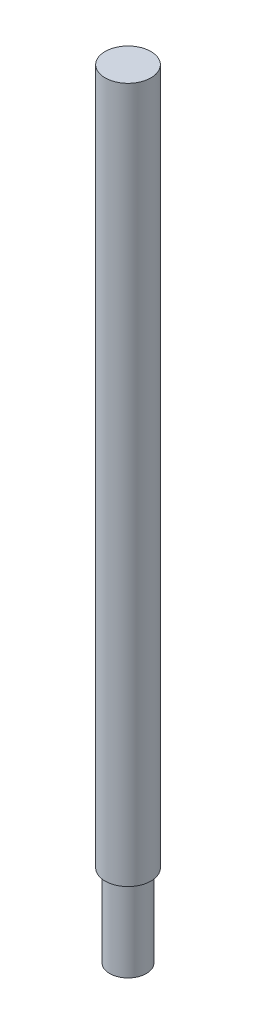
ISO-10303-21;
HEADER;
FILE_DESCRIPTION(('STEP AP214'),'2;1');
FILE_NAME('part.step','',(''),(''),'','','');
FILE_SCHEMA(('AUTOMOTIVE_DESIGN { 1 0 10303 214 1 1 1 1 }'));
ENDSEC;
DATA;
#1=APPLICATION_CONTEXT('core data for automotive mechanical design processes');
#2=APPLICATION_PROTOCOL_DEFINITION('international standard','automotive_design',2000,#1);
#3=PRODUCT_CONTEXT('',#1,'mechanical');
#4=PRODUCT('Part','Part','',(#3));
#5=PRODUCT_RELATED_PRODUCT_CATEGORY('part','',(#4));
#6=PRODUCT_DEFINITION_FORMATION('','',#4);
#7=PRODUCT_DEFINITION_CONTEXT('part definition',#1,'design');
#8=PRODUCT_DEFINITION('design','',#6,#7);
#9=PRODUCT_DEFINITION_SHAPE('','',#8);
#10=(LENGTH_UNIT() NAMED_UNIT(*) SI_UNIT(.MILLI.,.METRE.));
#11=(NAMED_UNIT(*) PLANE_ANGLE_UNIT() SI_UNIT($,.RADIAN.));
#12=(NAMED_UNIT(*) SI_UNIT($,.STERADIAN.) SOLID_ANGLE_UNIT());
#13=UNCERTAINTY_MEASURE_WITH_UNIT(LENGTH_MEASURE(1.E-05),#10,'distance_accuracy_value','');
#14=(GEOMETRIC_REPRESENTATION_CONTEXT(3) GLOBAL_UNCERTAINTY_ASSIGNED_CONTEXT((#13)) GLOBAL_UNIT_ASSIGNED_CONTEXT((#10,
#11,#12)) REPRESENTATION_CONTEXT('',''));
#15=CARTESIAN_POINT('',(0.,0.,0.));
#16=DIRECTION('',(0.,0.,1.));
#17=DIRECTION('',(1.,0.,0.));
#18=AXIS2_PLACEMENT_3D('',#15,#16,#17);
#19=CARTESIAN_POINT('',(0.,170.,0.));
#20=DIRECTION('',(0.,-1.,0.));
#21=DIRECTION('',(0.,0.,-1.));
#22=AXIS2_PLACEMENT_3D('',#19,#20,#21);
#23=CYLINDRICAL_SURFACE('',#22,5.);
#24=CARTESIAN_POINT('',(0.,170.,0.));
#25=DIRECTION('',(0.,1.,0.));
#26=DIRECTION('',(0.,0.,1.));
#27=AXIS2_PLACEMENT_3D('',#24,#25,#26);
#28=CIRCLE('',#27,5.);
#29=CARTESIAN_POINT('',(0.,170.,5.));
#30=VERTEX_POINT('',#29);
#31=EDGE_CURVE('E10',#30,#30,#28,.T.);
#32=ORIENTED_EDGE('',*,*,#31,.F.);
#33=EDGE_LOOP('',(#32));
#34=FACE_BOUND('',#33,.T.);
#35=CARTESIAN_POINT('',(0.,18.,0.));
#36=DIRECTION('',(0.,-1.,0.));
#37=DIRECTION('',(0.,0.,-1.));
#38=AXIS2_PLACEMENT_3D('',#35,#36,#37);
#39=CIRCLE('',#38,5.);
#40=CARTESIAN_POINT('',(0.,18.,-5.));
#41=VERTEX_POINT('',#40);
#42=EDGE_CURVE('E39',#41,#41,#39,.T.);
#43=ORIENTED_EDGE('',*,*,#42,.F.);
#44=EDGE_LOOP('',(#43));
#45=FACE_BOUND('',#44,.T.);
#46=ADVANCED_FACE('F33',(#34,#45),#23,.T.);
#47=CARTESIAN_POINT('',(0.,170.,0.));
#48=DIRECTION('',(0.,1.,0.));
#49=DIRECTION('',(0.,0.,1.));
#50=AXIS2_PLACEMENT_3D('',#47,#48,#49);
#51=PLANE('',#50);
#52=ORIENTED_EDGE('',*,*,#31,.T.);
#53=EDGE_LOOP('',(#52));
#54=FACE_BOUND('',#53,.T.);
#55=ADVANCED_FACE('F64',(#54),#51,.T.);
#56=CARTESIAN_POINT('',(0.,18.,0.));
#57=DIRECTION('',(0.,-1.,0.));
#58=DIRECTION('',(0.,0.,-1.));
#59=AXIS2_PLACEMENT_3D('',#56,#57,#58);
#60=PLANE('',#59);
#61=CARTESIAN_POINT('',(0.,18.,0.));
#62=DIRECTION('',(0.,-1.,0.));
#63=DIRECTION('',(0.,0.,-1.));
#64=AXIS2_PLACEMENT_3D('',#61,#62,#63);
#65=CIRCLE('',#64,4.);
#66=CARTESIAN_POINT('',(0.,18.,-4.));
#67=VERTEX_POINT('',#66);
#68=EDGE_CURVE('E43',#67,#67,#65,.T.);
#69=ORIENTED_EDGE('',*,*,#68,.F.);
#70=EDGE_LOOP('',(#69));
#71=FACE_BOUND('',#70,.T.);
#72=ORIENTED_EDGE('',*,*,#42,.T.);
#73=EDGE_LOOP('',(#72));
#74=FACE_BOUND('',#73,.T.);
#75=ADVANCED_FACE('F57',(#71,#74),#60,.T.);
#76=CARTESIAN_POINT('',(0.,18.,0.));
#77=DIRECTION('',(0.,-1.,0.));
#78=DIRECTION('',(0.,0.,-1.));
#79=AXIS2_PLACEMENT_3D('',#76,#77,#78);
#80=CYLINDRICAL_SURFACE('',#79,4.);
#81=ORIENTED_EDGE('',*,*,#68,.T.);
#82=EDGE_LOOP('',(#81));
#83=FACE_BOUND('',#82,.T.);
#84=CARTESIAN_POINT('',(0.,0.,0.));
#85=DIRECTION('',(0.,-1.,0.));
#86=DIRECTION('',(0.,0.,-1.));
#87=AXIS2_PLACEMENT_3D('',#84,#85,#86);
#88=CIRCLE('',#87,4.);
#89=CARTESIAN_POINT('',(0.,0.,-4.));
#90=VERTEX_POINT('',#89);
#91=EDGE_CURVE('E47',#90,#90,#88,.T.);
#92=ORIENTED_EDGE('',*,*,#91,.F.);
#93=EDGE_LOOP('',(#92));
#94=FACE_BOUND('',#93,.T.);
#95=ADVANCED_FACE('F55',(#83,#94),#80,.T.);
#96=CARTESIAN_POINT('',(0.,0.,0.));
#97=DIRECTION('',(0.,1.,0.));
#98=DIRECTION('',(0.,0.,1.));
#99=AXIS2_PLACEMENT_3D('',#96,#97,#98);
#100=PLANE('',#99);
#101=ORIENTED_EDGE('',*,*,#91,.T.);
#102=EDGE_LOOP('',(#101));
#103=FACE_BOUND('',#102,.T.);
#104=ADVANCED_FACE('F53',(#103),#100,.F.);
#105=CLOSED_SHELL('',(#46,#55,#75,#95,#104));
#106=MANIFOLD_SOLID_BREP('B2',#105);
#107=ADVANCED_BREP_SHAPE_REPRESENTATION('',(#18,#106),#14);
#108=SHAPE_DEFINITION_REPRESENTATION(#9,#107);
ENDSEC;
END-ISO-10303-21;
